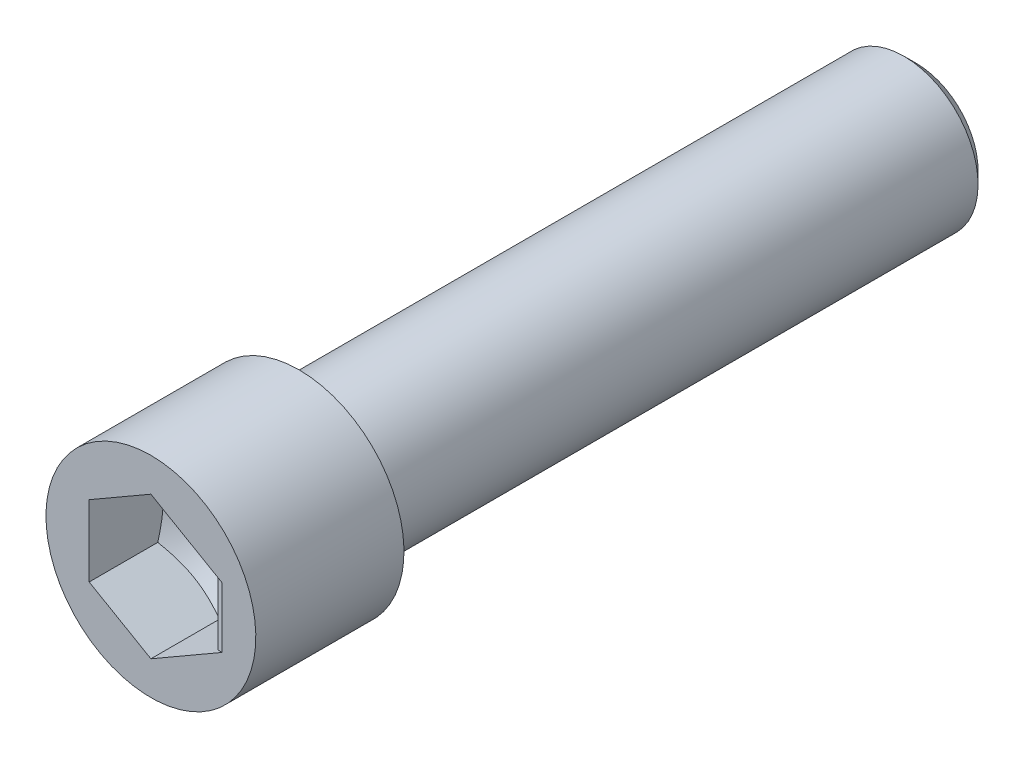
ISO-10303-21;
HEADER;
FILE_DESCRIPTION(('STEP AP214'),'2;1');
FILE_NAME('part.step','',(''),(''),'','','');
FILE_SCHEMA(('AUTOMOTIVE_DESIGN { 1 0 10303 214 1 1 1 1 }'));
ENDSEC;
DATA;
#1=APPLICATION_CONTEXT('core data for automotive mechanical design processes');
#2=APPLICATION_PROTOCOL_DEFINITION('international standard','automotive_design',2000,#1);
#3=PRODUCT_CONTEXT('',#1,'mechanical');
#4=PRODUCT('Part','Part','',(#3));
#5=PRODUCT_RELATED_PRODUCT_CATEGORY('part','',(#4));
#6=PRODUCT_DEFINITION_FORMATION('','',#4);
#7=PRODUCT_DEFINITION_CONTEXT('part definition',#1,'design');
#8=PRODUCT_DEFINITION('design','',#6,#7);
#9=PRODUCT_DEFINITION_SHAPE('','',#8);
#10=(LENGTH_UNIT() NAMED_UNIT(*) SI_UNIT(.MILLI.,.METRE.));
#11=(NAMED_UNIT(*) PLANE_ANGLE_UNIT() SI_UNIT($,.RADIAN.));
#12=(NAMED_UNIT(*) SI_UNIT($,.STERADIAN.) SOLID_ANGLE_UNIT());
#13=UNCERTAINTY_MEASURE_WITH_UNIT(LENGTH_MEASURE(1.E-05),#10,'distance_accuracy_value','');
#14=(GEOMETRIC_REPRESENTATION_CONTEXT(3) GLOBAL_UNCERTAINTY_ASSIGNED_CONTEXT((#13)) GLOBAL_UNIT_ASSIGNED_CONTEXT((#10,
#11,#12)) REPRESENTATION_CONTEXT('',''));
#15=CARTESIAN_POINT('',(0.,0.,0.));
#16=DIRECTION('',(0.,0.,1.));
#17=DIRECTION('',(1.,0.,0.));
#18=AXIS2_PLACEMENT_3D('',#15,#16,#17);
#19=CARTESIAN_POINT('',(2.5,-1.44337567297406,-25.001));
#20=DIRECTION('',(1.,0.,0.));
#21=DIRECTION('',(0.,1.,0.));
#22=AXIS2_PLACEMENT_3D('',#19,#20,#21);
#23=PLANE('',#22);
#24=DIRECTION('',(0.,0.,1.));
#25=VECTOR('',#24,1.);
#26=CARTESIAN_POINT('',(2.5,-1.44337567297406,-25.001));
#27=LINE('',#26,#25);
#28=CARTESIAN_POINT('',(2.50000000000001,-1.44337567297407,3.22329099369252));
#29=VERTEX_POINT('',#28);
#30=CARTESIAN_POINT('',(2.5,-1.44337567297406,5.7767090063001));
#31=VERTEX_POINT('',#30);
#32=EDGE_CURVE('E118',#29,#31,#27,.T.);
#33=ORIENTED_EDGE('',*,*,#32,.T.);
#34=DIRECTION('',(0.,1.,0.));
#35=VECTOR('',#34,1.);
#36=CARTESIAN_POINT('',(2.5,1.44337567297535,5.77670900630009));
#37=LINE('',#36,#35);
#38=CARTESIAN_POINT('',(2.5,1.44337567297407,5.77670900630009));
#39=VERTEX_POINT('',#38);
#40=EDGE_CURVE('E333',#31,#39,#37,.T.);
#41=ORIENTED_EDGE('',*,*,#40,.T.);
#42=DIRECTION('',(0.,0.,1.));
#43=VECTOR('',#42,1.);
#44=CARTESIAN_POINT('',(2.5,1.44337567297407,-25.001));
#45=LINE('',#44,#43);
#46=CARTESIAN_POINT('',(2.5,1.44337567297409,3.22329099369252));
#47=VERTEX_POINT('',#46);
#48=EDGE_CURVE('E315',#39,#47,#45,.F.);
#49=ORIENTED_EDGE('',*,*,#48,.T.);
#50=CARTESIAN_POINT('',(2.5,1.4433756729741,3.22329099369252));
#51=CARTESIAN_POINT('',(2.5,1.32488884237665,3.18908321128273));
#52=CARTESIAN_POINT('',(2.5,1.20546467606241,3.15776502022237));
#53=CARTESIAN_POINT('',(2.5,0.964676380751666,3.10241400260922));
#54=CARTESIAN_POINT('',(2.5,0.843308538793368,3.07839747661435));
#55=CARTESIAN_POINT('',(2.5,0.601934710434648,3.0397759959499));
#56=CARTESIAN_POINT('',(2.5,0.481962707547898,3.02496512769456));
#57=CARTESIAN_POINT('',(2.5,0.241326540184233,3.00508241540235));
#58=CARTESIAN_POINT('',(2.5,0.120663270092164,2.9999999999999));
#59=CARTESIAN_POINT('',(2.5,-0.12066327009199,2.99999999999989));
#60=CARTESIAN_POINT('',(2.5,-0.241326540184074,3.00508241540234));
#61=CARTESIAN_POINT('',(2.5,-0.481962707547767,3.02496512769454));
#62=CARTESIAN_POINT('',(2.5,-0.60193471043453,3.03977599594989));
#63=CARTESIAN_POINT('',(2.5,-0.843308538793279,3.07839747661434));
#64=CARTESIAN_POINT('',(2.5,-0.964676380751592,3.10241400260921));
#65=CARTESIAN_POINT('',(2.5,-1.20546467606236,3.15776502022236));
#66=CARTESIAN_POINT('',(2.5,-1.32488884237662,3.18908321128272));
#67=CARTESIAN_POINT('',(2.5,-1.44337567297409,3.22329099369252));
#68=B_SPLINE_CURVE_WITH_KNOTS('',3,(#50,#51,#52,#53,#54,#55,#56,#57,#58,#59,#60,#61,#62,#63,#64,
#65,#66,#67),.UNSPECIFIED.,.F.,.F.,(4,2,2,2,2,2,2,2,4),(0.,0.370091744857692,0.741003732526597,
1.10328857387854,1.46517951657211,1.82707045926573,2.18935530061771,2.56026728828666,
2.9303590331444),.UNSPECIFIED.);
#69=EDGE_CURVE('E112',#47,#29,#68,.T.);
#70=ORIENTED_EDGE('',*,*,#69,.T.);
#71=EDGE_LOOP('',(#33,#41,#49,#70));
#72=FACE_BOUND('',#71,.T.);
#73=ADVANCED_FACE('F42',(#72),#23,.F.);
#74=CARTESIAN_POINT('',(0.,0.,3.23329099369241));
#75=DIRECTION('',(0.,0.,1.));
#76=DIRECTION('',(1.,0.,0.));
#77=AXIS2_PLACEMENT_3D('',#74,#75,#76);
#78=CONICAL_SURFACE('',#77,2.90407185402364,1.04719755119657);
#79=CARTESIAN_POINT('',(2.22044604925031E-13,0.,1.55662432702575));
#80=VERTEX_POINT('',#79);
#81=VERTEX_LOOP('',#80);
#82=FACE_BOUND('',#81,.T.);
#83=CARTESIAN_POINT('',(0.,-2.88675134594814,3.22329099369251));
#84=CARTESIAN_POINT('',(0.109859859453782,-2.82332372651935,3.18666042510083));
#85=CARTESIAN_POINT('',(0.220668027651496,-2.75934860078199,3.15334684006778));
#86=CARTESIAN_POINT('',(0.444202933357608,-2.63029066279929,3.09519897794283));
#87=CARTESIAN_POINT('',(0.556933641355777,-2.56520555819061,3.07038526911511));
#88=CARTESIAN_POINT('',(0.78099804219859,-2.4358419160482,3.0317609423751));
#89=CARTESIAN_POINT('',(0.892297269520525,-2.37158327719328,3.01769322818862));
#90=CARTESIAN_POINT('',(1.11541915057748,-2.24276379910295,3.00090245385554));
#91=CARTESIAN_POINT('',(1.22724099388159,-2.17820342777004,2.99816548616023));
#92=CARTESIAN_POINT('',(1.43616811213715,-2.05757929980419,3.00387385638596));
#93=CARTESIAN_POINT('',(1.53330473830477,-2.00149744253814,3.0109176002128));
#94=CARTESIAN_POINT('',(1.72694517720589,-1.88969908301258,3.03323761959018));
#95=CARTESIAN_POINT('',(1.82344832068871,-1.83398296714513,3.04852151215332));
#96=CARTESIAN_POINT('',(2.01748767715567,-1.72195429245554,3.08672828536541));
#97=CARTESIAN_POINT('',(2.11499934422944,-1.66565590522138,3.10981304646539));
#98=CARTESIAN_POINT('',(2.30856871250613,-1.55389857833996,3.1622056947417));
#99=CARTESIAN_POINT('',(2.40462889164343,-1.49843820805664,3.19150127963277));
#100=CARTESIAN_POINT('',(2.50000000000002,-1.44337567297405,3.22329099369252));
#101=B_SPLINE_CURVE_WITH_KNOTS('',3,(#83,#84,#85,#86,#87,#88,#89,#90,#91,#92,#93,#94,#95,#96,
#97,#98,#99,#100),.UNSPECIFIED.,.F.,.F.,(4,2,2,2,2,2,2,2,4),(0.,0.396270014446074,
0.793492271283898,1.18088450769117,1.5678011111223,1.9046347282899,2.24178024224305,
2.58640202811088,2.93034746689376),.UNSPECIFIED.);
#102=CARTESIAN_POINT('',(0.,-2.88675134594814,3.22329099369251));
#103=VERTEX_POINT('',#102);
#104=EDGE_CURVE('E110',#103,#29,#101,.T.);
#105=ORIENTED_EDGE('',*,*,#104,.T.);
#106=ORIENTED_EDGE('',*,*,#69,.F.);
#107=CARTESIAN_POINT('',(2.50000000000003,1.44337567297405,3.22329099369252));
#108=CARTESIAN_POINT('',(2.39014014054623,1.50680329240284,3.18666042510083));
#109=CARTESIAN_POINT('',(2.27933197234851,1.5707784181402,3.15334684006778));
#110=CARTESIAN_POINT('',(2.0557970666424,1.6998363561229,3.09519897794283));
#111=CARTESIAN_POINT('',(1.94306635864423,1.76492146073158,3.07038526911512));
#112=CARTESIAN_POINT('',(1.71900195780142,1.89428510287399,3.0317609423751));
#113=CARTESIAN_POINT('',(1.60770273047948,1.95854374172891,3.01769322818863));
#114=CARTESIAN_POINT('',(1.38458084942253,2.08736321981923,3.00090245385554));
#115=CARTESIAN_POINT('',(1.27275900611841,2.15192359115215,2.99816548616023));
#116=CARTESIAN_POINT('',(1.06383188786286,2.272547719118,3.00387385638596));
#117=CARTESIAN_POINT('',(0.966695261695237,2.32862957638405,3.0109176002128));
#118=CARTESIAN_POINT('',(0.773054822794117,2.44042793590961,3.03323761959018));
#119=CARTESIAN_POINT('',(0.676551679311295,2.49614405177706,3.04852151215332));
#120=CARTESIAN_POINT('',(0.48251232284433,2.60817272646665,3.08672828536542));
#121=CARTESIAN_POINT('',(0.385000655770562,2.66447111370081,3.10981304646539));
#122=CARTESIAN_POINT('',(0.191431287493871,2.77622844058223,3.1622056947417));
#123=CARTESIAN_POINT('',(0.0953711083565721,2.83168881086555,3.19150127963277));
#124=CARTESIAN_POINT('',(0.,2.88675134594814,3.22329099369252));
#125=B_SPLINE_CURVE_WITH_KNOTS('',3,(#107,#108,#109,#110,#111,#112,#113,#114,#115,#116,#117,
#118,#119,#120,#121,#122,#123,#124),.UNSPECIFIED.,.F.,.F.,(4,2,2,2,2,2,2,2,4),(0.,
0.396270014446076,0.7934922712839,1.18088450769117,1.5678011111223,1.9046347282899,
2.24178024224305,2.58640202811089,2.93034746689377),.UNSPECIFIED.);
#126=CARTESIAN_POINT('',(0.,2.88675134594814,3.22329099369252));
#127=VERTEX_POINT('',#126);
#128=EDGE_CURVE('E203',#47,#127,#125,.T.);
#129=ORIENTED_EDGE('',*,*,#128,.T.);
#130=CARTESIAN_POINT('',(0.,2.88675134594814,3.22329099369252));
#131=CARTESIAN_POINT('',(-0.109859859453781,2.82332372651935,3.18666042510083));
#132=CARTESIAN_POINT('',(-0.220668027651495,2.75934860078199,3.15334684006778));
#133=CARTESIAN_POINT('',(-0.444202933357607,2.63029066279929,3.09519897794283));
#134=CARTESIAN_POINT('',(-0.556933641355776,2.56520555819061,3.07038526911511));
#135=CARTESIAN_POINT('',(-0.78099804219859,2.4358419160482,3.0317609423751));
#136=CARTESIAN_POINT('',(-0.892297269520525,2.37158327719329,3.01769322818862));
#137=CARTESIAN_POINT('',(-1.11541915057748,2.24276379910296,3.00090245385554));
#138=CARTESIAN_POINT('',(-1.22724099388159,2.17820342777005,2.99816548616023));
#139=CARTESIAN_POINT('',(-1.43616811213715,2.05757929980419,3.00387385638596));
#140=CARTESIAN_POINT('',(-1.53330473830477,2.00149744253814,3.0109176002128));
#141=CARTESIAN_POINT('',(-1.72694517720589,1.88969908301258,3.03323761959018));
#142=CARTESIAN_POINT('',(-1.82344832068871,1.83398296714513,3.04852151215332));
#143=CARTESIAN_POINT('',(-2.01748767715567,1.72195429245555,3.08672828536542));
#144=CARTESIAN_POINT('',(-2.11499934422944,1.66565590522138,3.10981304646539));
#145=CARTESIAN_POINT('',(-2.30856871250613,1.55389857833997,3.1622056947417));
#146=CARTESIAN_POINT('',(-2.40462889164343,1.49843820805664,3.19150127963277));
#147=CARTESIAN_POINT('',(-2.50000000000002,1.44337567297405,3.22329099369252));
#148=B_SPLINE_CURVE_WITH_KNOTS('',3,(#130,#131,#132,#133,#134,#135,#136,#137,#138,#139,#140,
#141,#142,#143,#144,#145,#146,#147),.UNSPECIFIED.,.F.,.F.,(4,2,2,2,2,2,2,2,4),(0.,
0.396270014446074,0.793492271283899,1.18088450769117,1.5678011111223,1.9046347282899,
2.24178024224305,2.58640202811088,2.93034746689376),.UNSPECIFIED.);
#149=CARTESIAN_POINT('',(-2.50000000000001,1.44337567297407,3.22329099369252));
#150=VERTEX_POINT('',#149);
#151=EDGE_CURVE('E258',#127,#150,#148,.T.);
#152=ORIENTED_EDGE('',*,*,#151,.T.);
#153=CARTESIAN_POINT('',(-2.5,1.44337567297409,3.22329099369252));
#154=CARTESIAN_POINT('',(-2.5,1.32488884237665,3.18908321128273));
#155=CARTESIAN_POINT('',(-2.5,1.20546467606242,3.15776502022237));
#156=CARTESIAN_POINT('',(-2.5,0.964676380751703,3.10241400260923));
#157=CARTESIAN_POINT('',(-2.5,0.843308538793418,3.07839747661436));
#158=CARTESIAN_POINT('',(-2.5,0.601934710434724,3.03977599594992));
#159=CARTESIAN_POINT('',(-2.5,0.481962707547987,3.02496512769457));
#160=CARTESIAN_POINT('',(-2.5,0.241326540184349,3.00508241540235));
#161=CARTESIAN_POINT('',(-2.5,0.120663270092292,2.9999999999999));
#162=CARTESIAN_POINT('',(-2.5,-0.120663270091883,2.99999999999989));
#163=CARTESIAN_POINT('',(-2.5,-0.241326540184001,3.00508241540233));
#164=CARTESIAN_POINT('',(-2.5,-0.481962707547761,3.02496512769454));
#165=CARTESIAN_POINT('',(-2.5,-0.601934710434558,3.03977599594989));
#166=CARTESIAN_POINT('',(-2.5,-0.843308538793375,3.07839747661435));
#167=CARTESIAN_POINT('',(-2.5,-0.964676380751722,3.10241400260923));
#168=CARTESIAN_POINT('',(-2.5,-1.20546467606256,3.15776502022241));
#169=CARTESIAN_POINT('',(-2.5,-1.32488884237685,3.18908321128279));
#170=CARTESIAN_POINT('',(-2.5,-1.44337567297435,3.22329099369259));
#171=B_SPLINE_CURVE_WITH_KNOTS('',3,(#153,#154,#155,#156,#157,#158,#159,#160,#161,#162,#163,
#164,#165,#166,#167,#168,#169,#170),.UNSPECIFIED.,.F.,.F.,(4,2,2,2,2,2,2,2,4),(0.,
0.370091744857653,0.741003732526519,1.10328857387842,1.46517951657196,1.82707045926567,
2.18935530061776,2.56026728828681,2.93035903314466),.UNSPECIFIED.);
#172=CARTESIAN_POINT('',(-2.49999999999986,-1.44337567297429,3.2232909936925));
#173=VERTEX_POINT('',#172);
#174=EDGE_CURVE('E251',#150,#173,#171,.T.);
#175=ORIENTED_EDGE('',*,*,#174,.T.);
#176=CARTESIAN_POINT('',(-2.49999999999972,-1.44337567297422,3.22329099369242));
#177=CARTESIAN_POINT('',(-2.39014014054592,-1.50680329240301,3.18666042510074));
#178=CARTESIAN_POINT('',(-2.27933197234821,-1.57077841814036,3.1533468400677));
#179=CARTESIAN_POINT('',(-2.05579706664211,-1.69983635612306,3.09519897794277));
#180=CARTESIAN_POINT('',(-1.94306635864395,-1.76492146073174,3.07038526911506));
#181=CARTESIAN_POINT('',(-1.71900195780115,-1.89428510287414,3.03176094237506));
#182=CARTESIAN_POINT('',(-1.60770273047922,-1.95854374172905,3.01769322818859));
#183=CARTESIAN_POINT('',(-1.38458084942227,-2.08736321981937,3.00090245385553));
#184=CARTESIAN_POINT('',(-1.27275900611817,-2.15192359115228,2.99816548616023));
#185=CARTESIAN_POINT('',(-1.06383188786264,-2.27254771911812,3.00387385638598));
#186=CARTESIAN_POINT('',(-0.966695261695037,-2.32862957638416,3.01091760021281));
#187=CARTESIAN_POINT('',(-0.773054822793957,-2.4404279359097,3.0332376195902));
#188=CARTESIAN_POINT('',(-0.676551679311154,-2.49614405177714,3.04852151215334));
#189=CARTESIAN_POINT('',(-0.482512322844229,-2.6081727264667,3.08672828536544));
#190=CARTESIAN_POINT('',(-0.385000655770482,-2.66447111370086,3.1098130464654));
#191=CARTESIAN_POINT('',(-0.191431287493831,-2.77622844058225,3.16220569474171));
#192=CARTESIAN_POINT('',(-0.0953711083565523,-2.83168881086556,3.19150127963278));
#193=CARTESIAN_POINT('',(0.,-2.88675134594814,3.22329099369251));
#194=B_SPLINE_CURVE_WITH_KNOTS('',3,(#176,#177,#178,#179,#180,#181,#182,#183,#184,#185,#186,
#187,#188,#189,#190,#191,#192,#193),.UNSPECIFIED.,.F.,.F.,(4,2,2,2,2,2,2,2,4),(0.,
0.396270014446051,0.793492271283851,1.1808845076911,1.56780111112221,1.90463472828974,
2.24178024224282,2.58640202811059,2.9303474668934),.UNSPECIFIED.);
#195=EDGE_CURVE('E115',#173,#103,#194,.T.);
#196=ORIENTED_EDGE('',*,*,#195,.T.);
#197=EDGE_LOOP('',(#105,#106,#129,#152,#175,#196));
#198=FACE_BOUND('',#197,.T.);
#199=ADVANCED_FACE('F102',(#82,#198),#78,.F.);
#200=CARTESIAN_POINT('',(0.,-2.88675134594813,-25.001));
#201=DIRECTION('',(0.5,-0.866025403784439,0.));
#202=DIRECTION('',(0.866025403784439,0.5,0.));
#203=AXIS2_PLACEMENT_3D('',#200,#201,#202);
#204=PLANE('',#203);
#205=ORIENTED_EDGE('',*,*,#32,.F.);
#206=ORIENTED_EDGE('',*,*,#104,.F.);
#207=DIRECTION('',(0.,0.,1.));
#208=VECTOR('',#207,1.);
#209=CARTESIAN_POINT('',(0.,-2.88675134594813,-25.001));
#210=LINE('',#209,#208);
#211=CARTESIAN_POINT('',(0.,-2.88675134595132,5.99999999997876));
#212=VERTEX_POINT('',#211);
#213=EDGE_CURVE('E129',#103,#212,#210,.T.);
#214=ORIENTED_EDGE('',*,*,#213,.T.);
#215=DIRECTION('',(0.866025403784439,0.5,0.));
#216=VECTOR('',#215,1.);
#217=CARTESIAN_POINT('',(1.25,-2.1650635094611,6.));
#218=LINE('',#217,#216);
#219=CARTESIAN_POINT('',(2.8867513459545,-1.22008467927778,6.));
#220=VERTEX_POINT('',#219);
#221=EDGE_CURVE('E64',#212,#220,#218,.T.);
#222=ORIENTED_EDGE('',*,*,#221,.T.);
#223=DIRECTION('',(-0.774596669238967,-0.447213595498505,-0.447213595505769));
#224=VECTOR('',#223,1.);
#225=CARTESIAN_POINT('',(-10.1617111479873,-8.75361801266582,-1.5335333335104));
#226=LINE('',#225,#224);
#227=EDGE_CURVE('E13',#220,#31,#226,.T.);
#228=ORIENTED_EDGE('',*,*,#227,.T.);
#229=EDGE_LOOP('',(#205,#206,#214,#222,#228));
#230=FACE_BOUND('',#229,.T.);
#231=ADVANCED_FACE('F105',(#230),#204,.F.);
#232=CARTESIAN_POINT('',(-2.5,-1.44337567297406,-25.001));
#233=DIRECTION('',(-0.5,-0.866025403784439,0.));
#234=DIRECTION('',(0.866025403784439,-0.5,0.));
#235=AXIS2_PLACEMENT_3D('',#232,#233,#234);
#236=PLANE('',#235);
#237=ORIENTED_EDGE('',*,*,#213,.F.);
#238=ORIENTED_EDGE('',*,*,#195,.F.);
#239=DIRECTION('',(0.,0.,1.));
#240=VECTOR('',#239,1.);
#241=CARTESIAN_POINT('',(-2.5,-1.44337567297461,-25.001));
#242=LINE('',#241,#240);
#243=CARTESIAN_POINT('',(-2.50000000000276,-1.44337567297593,5.99999999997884));
#244=VERTEX_POINT('',#243);
#245=EDGE_CURVE('E257',#173,#244,#242,.T.);
#246=ORIENTED_EDGE('',*,*,#245,.T.);
#247=DIRECTION('',(0.866025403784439,-0.5,0.));
#248=VECTOR('',#247,1.);
#249=CARTESIAN_POINT('',(-1.25,-2.1650635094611,6.));
#250=LINE('',#249,#248);
#251=EDGE_CURVE('E183',#244,#212,#250,.T.);
#252=ORIENTED_EDGE('',*,*,#251,.T.);
#253=EDGE_LOOP('',(#237,#238,#246,#252));
#254=FACE_BOUND('',#253,.T.);
#255=ADVANCED_FACE('F237',(#254),#236,.F.);
#256=CARTESIAN_POINT('',(-2.5,1.44337567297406,-25.001));
#257=DIRECTION('',(-1.,0.,0.));
#258=DIRECTION('',(0.,0.,1.));
#259=AXIS2_PLACEMENT_3D('',#256,#257,#258);
#260=PLANE('',#259);
#261=ORIENTED_EDGE('',*,*,#245,.F.);
#262=ORIENTED_EDGE('',*,*,#174,.F.);
#263=DIRECTION('',(0.,0.,1.));
#264=VECTOR('',#263,1.);
#265=CARTESIAN_POINT('',(-2.5,1.44337567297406,-25.001));
#266=LINE('',#265,#264);
#267=CARTESIAN_POINT('',(-2.50000000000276,1.44337567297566,5.99999999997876));
#268=VERTEX_POINT('',#267);
#269=EDGE_CURVE('E264',#150,#268,#266,.T.);
#270=ORIENTED_EDGE('',*,*,#269,.T.);
#271=DIRECTION('',(0.,-1.,0.));
#272=VECTOR('',#271,1.);
#273=CARTESIAN_POINT('',(-2.5,0.,6.));
#274=LINE('',#273,#272);
#275=EDGE_CURVE('E185',#268,#244,#274,.T.);
#276=ORIENTED_EDGE('',*,*,#275,.T.);
#277=EDGE_LOOP('',(#261,#262,#270,#276));
#278=FACE_BOUND('',#277,.T.);
#279=ADVANCED_FACE('F241',(#278),#260,.F.);
#280=CARTESIAN_POINT('',(0.,2.88675134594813,-25.001));
#281=DIRECTION('',(-0.5,0.866025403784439,0.));
#282=DIRECTION('',(-0.866025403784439,-0.5,0.));
#283=AXIS2_PLACEMENT_3D('',#280,#281,#282);
#284=PLANE('',#283);
#285=ORIENTED_EDGE('',*,*,#269,.F.);
#286=ORIENTED_EDGE('',*,*,#151,.F.);
#287=DIRECTION('',(0.,0.,1.));
#288=VECTOR('',#287,1.);
#289=CARTESIAN_POINT('',(0.,2.88675134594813,-25.001));
#290=LINE('',#289,#288);
#291=CARTESIAN_POINT('',(0.,2.88675134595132,5.99999999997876));
#292=VERTEX_POINT('',#291);
#293=EDGE_CURVE('E202',#127,#292,#290,.T.);
#294=ORIENTED_EDGE('',*,*,#293,.T.);
#295=DIRECTION('',(0.866025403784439,0.5,0.));
#296=VECTOR('',#295,1.);
#297=CARTESIAN_POINT('',(0.,2.88675134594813,6.));
#298=LINE('',#297,#296);
#299=EDGE_CURVE('E188',#268,#292,#298,.T.);
#300=ORIENTED_EDGE('',*,*,#299,.F.);
#301=EDGE_LOOP('',(#285,#286,#294,#300));
#302=FACE_BOUND('',#301,.T.);
#303=ADVANCED_FACE('F265',(#302),#284,.F.);
#304=CARTESIAN_POINT('',(2.5,1.44337567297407,-25.001));
#305=DIRECTION('',(0.5,0.866025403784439,0.));
#306=DIRECTION('',(-0.866025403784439,0.5,0.));
#307=AXIS2_PLACEMENT_3D('',#304,#305,#306);
#308=PLANE('',#307);
#309=ORIENTED_EDGE('',*,*,#293,.F.);
#310=ORIENTED_EDGE('',*,*,#128,.F.);
#311=ORIENTED_EDGE('',*,*,#48,.F.);
#312=DIRECTION('',(0.774596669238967,-0.447213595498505,0.447213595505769));
#313=VECTOR('',#312,1.);
#314=CARTESIAN_POINT('',(-8.1617111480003,7.59891747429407,-0.378832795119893));
#315=LINE('',#314,#313);
#316=CARTESIAN_POINT('',(2.8867513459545,1.22008467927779,6.));
#317=VERTEX_POINT('',#316);
#318=EDGE_CURVE('E50',#39,#317,#315,.T.);
#319=ORIENTED_EDGE('',*,*,#318,.T.);
#320=DIRECTION('',(-0.866025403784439,0.5,0.));
#321=VECTOR('',#320,1.);
#322=CARTESIAN_POINT('',(1.25,2.1650635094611,6.));
#323=LINE('',#322,#321);
#324=EDGE_CURVE('E57',#317,#292,#323,.T.);
#325=ORIENTED_EDGE('',*,*,#324,.T.);
#326=EDGE_LOOP('',(#309,#310,#311,#319,#325));
#327=FACE_BOUND('',#326,.T.);
#328=ADVANCED_FACE('F222',(#327),#308,.F.);
#329=CARTESIAN_POINT('',(0.,0.,6.));
#330=DIRECTION('',(0.,0.,1.));
#331=DIRECTION('',(0.,-1.,0.));
#332=AXIS2_PLACEMENT_3D('',#329,#330,#331);
#333=PLANE('',#332);
#334=ORIENTED_EDGE('',*,*,#324,.F.);
#335=DIRECTION('',(0.,-1.,0.));
#336=VECTOR('',#335,1.);
#337=CARTESIAN_POINT('',(2.8867513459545,-1.44337567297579,6.));
#338=LINE('',#337,#336);
#339=EDGE_CURVE('E331',#317,#220,#338,.T.);
#340=ORIENTED_EDGE('',*,*,#339,.T.);
#341=ORIENTED_EDGE('',*,*,#221,.F.);
#342=ORIENTED_EDGE('',*,*,#251,.F.);
#343=ORIENTED_EDGE('',*,*,#275,.F.);
#344=ORIENTED_EDGE('',*,*,#299,.T.);
#345=EDGE_LOOP('',(#334,#340,#341,#342,#343,#344));
#346=FACE_BOUND('',#345,.T.);
#347=CARTESIAN_POINT('',(0.,0.,6.));
#348=DIRECTION('',(0.,0.,-1.));
#349=DIRECTION('',(0.,1.,0.));
#350=AXIS2_PLACEMENT_3D('',#347,#348,#349);
#351=CIRCLE('',#350,4.25);
#352=CARTESIAN_POINT('',(0.,4.25,6.));
#353=VERTEX_POINT('',#352);
#354=EDGE_CURVE('E197',#353,#353,#351,.T.);
#355=ORIENTED_EDGE('',*,*,#354,.F.);
#356=EDGE_LOOP('',(#355));
#357=FACE_BOUND('',#356,.T.);
#358=ADVANCED_FACE('F273',(#346,#357),#333,.T.);
#359=CARTESIAN_POINT('',(0.,0.,-25.));
#360=DIRECTION('',(0.,0.,-1.));
#361=DIRECTION('',(0.,1.,0.));
#362=AXIS2_PLACEMENT_3D('',#359,#360,#361);
#363=CYLINDRICAL_SURFACE('',#362,4.25);
#364=ORIENTED_EDGE('',*,*,#354,.T.);
#365=EDGE_LOOP('',(#364));
#366=FACE_BOUND('',#365,.T.);
#367=CARTESIAN_POINT('',(0.,0.,0.));
#368=DIRECTION('',(0.,0.,-1.));
#369=DIRECTION('',(0.,1.,0.));
#370=AXIS2_PLACEMENT_3D('',#367,#368,#369);
#371=CIRCLE('',#370,4.25);
#372=CARTESIAN_POINT('',(0.,4.25,0.));
#373=VERTEX_POINT('',#372);
#374=EDGE_CURVE('E136',#373,#373,#371,.T.);
#375=ORIENTED_EDGE('',*,*,#374,.F.);
#376=EDGE_LOOP('',(#375));
#377=FACE_BOUND('',#376,.T.);
#378=ADVANCED_FACE('F279',(#366,#377),#363,.T.);
#379=CARTESIAN_POINT('',(0.,4.25,0.));
#380=DIRECTION('',(0.,0.,-1.));
#381=DIRECTION('',(0.,1.,0.));
#382=AXIS2_PLACEMENT_3D('',#379,#380,#381);
#383=PLANE('',#382);
#384=CARTESIAN_POINT('',(0.,0.,0.));
#385=DIRECTION('',(0.,0.,-1.));
#386=DIRECTION('',(0.,1.,0.));
#387=AXIS2_PLACEMENT_3D('',#384,#385,#386);
#388=CIRCLE('',#387,3.);
#389=CARTESIAN_POINT('',(0.,3.,0.));
#390=VERTEX_POINT('',#389);
#391=EDGE_CURVE('E348',#390,#390,#388,.T.);
#392=ORIENTED_EDGE('',*,*,#391,.F.);
#393=EDGE_LOOP('',(#392));
#394=FACE_BOUND('',#393,.T.);
#395=ORIENTED_EDGE('',*,*,#374,.T.);
#396=EDGE_LOOP('',(#395));
#397=FACE_BOUND('',#396,.T.);
#398=ADVANCED_FACE('F277',(#394,#397),#383,.T.);
#399=CARTESIAN_POINT('',(0.,0.,-25.));
#400=DIRECTION('',(0.,0.,1.));
#401=DIRECTION('',(0.,-1.,0.));
#402=AXIS2_PLACEMENT_3D('',#399,#400,#401);
#403=CYLINDRICAL_SURFACE('',#402,3.);
#404=CARTESIAN_POINT('',(0.,0.,-24.4999999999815));
#405=DIRECTION('',(0.,0.,-1.));
#406=DIRECTION('',(0.,1.,0.));
#407=AXIS2_PLACEMENT_3D('',#404,#405,#406);
#408=CIRCLE('',#407,3.);
#409=CARTESIAN_POINT('',(0.,3.,-24.4999999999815));
#410=VERTEX_POINT('',#409);
#411=EDGE_CURVE('E336',#410,#410,#408,.F.);
#412=ORIENTED_EDGE('',*,*,#411,.T.);
#413=EDGE_LOOP('',(#412));
#414=FACE_BOUND('',#413,.T.);
#415=ORIENTED_EDGE('',*,*,#391,.T.);
#416=EDGE_LOOP('',(#415));
#417=FACE_BOUND('',#416,.T.);
#418=ADVANCED_FACE('F165',(#414,#417),#403,.T.);
#419=CARTESIAN_POINT('',(0.,0.,-25.));
#420=DIRECTION('',(0.,0.,-1.));
#421=DIRECTION('',(0.,1.,0.));
#422=AXIS2_PLACEMENT_3D('',#419,#420,#421);
#423=PLANE('',#422);
#424=CARTESIAN_POINT('',(0.,0.,-25.));
#425=DIRECTION('',(0.,0.,-1.));
#426=DIRECTION('',(0.,1.,0.));
#427=AXIS2_PLACEMENT_3D('',#424,#425,#426);
#428=CIRCLE('',#427,2.49999999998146);
#429=CARTESIAN_POINT('',(0.,2.49999999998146,-25.));
#430=VERTEX_POINT('',#429);
#431=EDGE_CURVE('E339',#430,#430,#428,.T.);
#432=ORIENTED_EDGE('',*,*,#431,.T.);
#433=EDGE_LOOP('',(#432));
#434=FACE_BOUND('',#433,.T.);
#435=ADVANCED_FACE('F286',(#434),#423,.T.);
#436=CARTESIAN_POINT('',(0.,0.,-25.));
#437=DIRECTION('',(0.,0.,1.));
#438=DIRECTION('',(0.,-1.,0.));
#439=AXIS2_PLACEMENT_3D('',#436,#437,#438);
#440=CONICAL_SURFACE('',#439,2.49999999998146,0.785398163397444);
#441=ORIENTED_EDGE('',*,*,#411,.F.);
#442=EDGE_LOOP('',(#441));
#443=FACE_BOUND('',#442,.T.);
#444=ORIENTED_EDGE('',*,*,#431,.F.);
#445=EDGE_LOOP('',(#444));
#446=FACE_BOUND('',#445,.T.);
#447=ADVANCED_FACE('F167',(#443,#446),#440,.T.);
#448=CARTESIAN_POINT('',(2.5,-1.44337567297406,5.77670900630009));
#449=DIRECTION('',(-0.500000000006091,0.,0.866025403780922));
#450=DIRECTION('',(0.,-1.,0.));
#451=AXIS2_PLACEMENT_3D('',#448,#449,#450);
#452=PLANE('',#451);
#453=ORIENTED_EDGE('',*,*,#227,.F.);
#454=ORIENTED_EDGE('',*,*,#339,.F.);
#455=ORIENTED_EDGE('',*,*,#318,.F.);
#456=ORIENTED_EDGE('',*,*,#40,.F.);
#457=EDGE_LOOP('',(#453,#454,#455,#456));
#458=FACE_BOUND('',#457,.T.);
#459=ADVANCED_FACE('F44',(#458),#452,.T.);
#460=CLOSED_SHELL('',(#73,#199,#231,#255,#279,#303,#328,#358,#378,#398,#418,#435,#447,#459));
#461=MANIFOLD_SOLID_BREP('B2',#460);
#462=ADVANCED_BREP_SHAPE_REPRESENTATION('',(#18,#461),#14);
#463=SHAPE_DEFINITION_REPRESENTATION(#9,#462);
ENDSEC;
END-ISO-10303-21;
